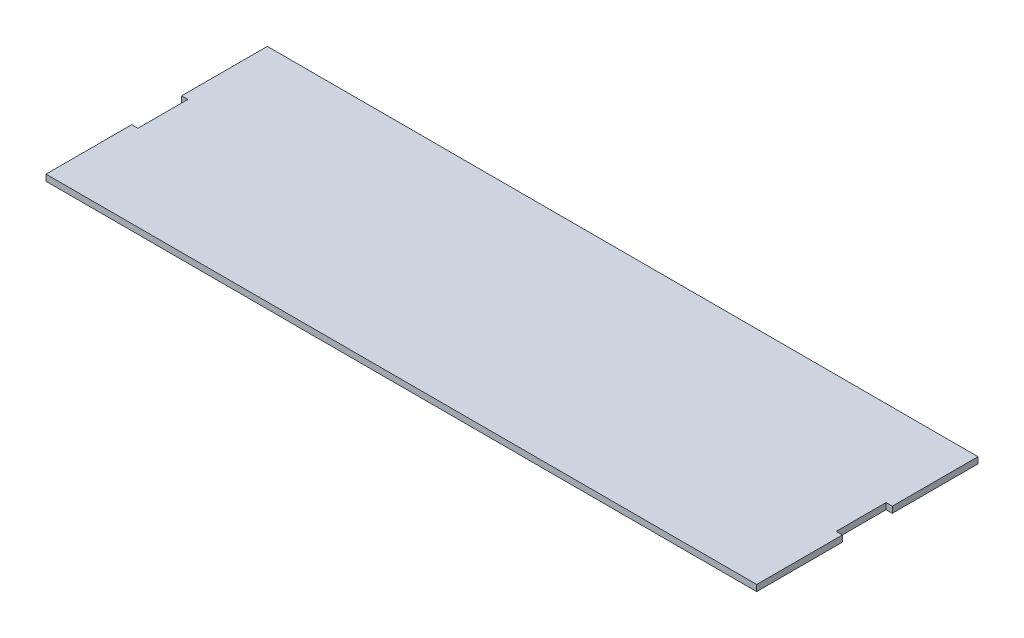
from build123d import *

# Parameters (mm, degrees)
ESQUISSE1_W             = 228
ESQUISSE1_H             = 71
EXTRUSION1_DEPTH        = 2
ESQUISSE2_W             = 11.02396514
ESQUISSE2_H             = 16
ENL_V_MAT_EXTRU_1_DEPTH = 120.416288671
ESQUISSE3_W             = 11.98257081
ESQUISSE3_H             = 16
ENL_V_MAT_EXTRU_2_DEPTH = 120.416288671


with BuildPart() as part:
    # Esquisse1 → Extrusion1 (new body)
    with BuildSketch(Plane(origin=(0, 0, 0), x_dir=(1, 0, 0), z_dir=(0, 1, 0))):
        Rectangle(ESQUISSE1_W, ESQUISSE1_H)
    extrude(amount=EXTRUSION1_DEPTH)

    # Esquisse2 → Enl_v. mat.-Extru.1 (cut, through all)
    with BuildSketch(Plane(origin=(0, 2, 0), x_dir=(-1, 0, 0), z_dir=(0, 1, 0))):
        with Locations((-117.51198257, 0)):
            Rectangle(ESQUISSE2_W, ESQUISSE2_H)
    extrude(amount=-ENL_V_MAT_EXTRU_1_DEPTH, mode=Mode.SUBTRACT)

    # Esquisse3 → Enl_v. mat.-Extru.2 (cut, through all)
    with BuildSketch(Plane(origin=(0, 2, 0), x_dir=(-1, 0, 0), z_dir=(0, 1, 0))):
        with Locations((117.991285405, 0)):
            Rectangle(ESQUISSE3_W, ESQUISSE3_H)
    extrude(amount=-ENL_V_MAT_EXTRU_2_DEPTH, mode=Mode.SUBTRACT)


solid = part.part
